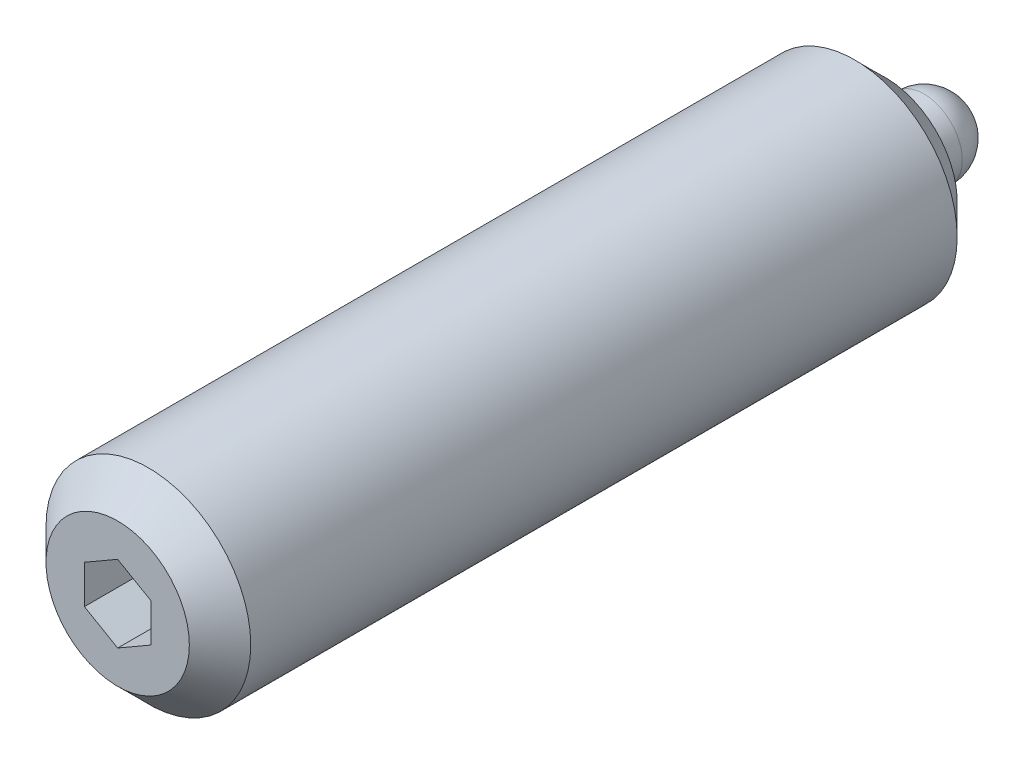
ISO-10303-21;
HEADER;
FILE_DESCRIPTION(('STEP AP214'),'2;1');
FILE_NAME('part.step','',(''),(''),'','','');
FILE_SCHEMA(('AUTOMOTIVE_DESIGN { 1 0 10303 214 1 1 1 1 }'));
ENDSEC;
DATA;
#1=APPLICATION_CONTEXT('core data for automotive mechanical design processes');
#2=APPLICATION_PROTOCOL_DEFINITION('international standard','automotive_design',2000,#1);
#3=PRODUCT_CONTEXT('',#1,'mechanical');
#4=PRODUCT('Part','Part','',(#3));
#5=PRODUCT_RELATED_PRODUCT_CATEGORY('part','',(#4));
#6=PRODUCT_DEFINITION_FORMATION('','',#4);
#7=PRODUCT_DEFINITION_CONTEXT('part definition',#1,'design');
#8=PRODUCT_DEFINITION('design','',#6,#7);
#9=PRODUCT_DEFINITION_SHAPE('','',#8);
#10=(LENGTH_UNIT() NAMED_UNIT(*) SI_UNIT(.MILLI.,.METRE.));
#11=(NAMED_UNIT(*) PLANE_ANGLE_UNIT() SI_UNIT($,.RADIAN.));
#12=(NAMED_UNIT(*) SI_UNIT($,.STERADIAN.) SOLID_ANGLE_UNIT());
#13=UNCERTAINTY_MEASURE_WITH_UNIT(LENGTH_MEASURE(1.E-05),#10,'distance_accuracy_value','');
#14=(GEOMETRIC_REPRESENTATION_CONTEXT(3) GLOBAL_UNCERTAINTY_ASSIGNED_CONTEXT((#13)) GLOBAL_UNIT_ASSIGNED_CONTEXT((#10,
#11,#12)) REPRESENTATION_CONTEXT('',''));
#15=CARTESIAN_POINT('',(0.,0.,0.));
#16=DIRECTION('',(0.,0.,1.));
#17=DIRECTION('',(1.,0.,0.));
#18=AXIS2_PLACEMENT_3D('',#15,#16,#17);
#19=CARTESIAN_POINT('',(0.,2.,16.5));
#20=DIRECTION('',(0.,0.,1.));
#21=DIRECTION('',(1.,0.,0.));
#22=AXIS2_PLACEMENT_3D('',#19,#20,#21);
#23=PLANE('',#22);
#24=CARTESIAN_POINT('',(0.,0.,16.5));
#25=DIRECTION('',(0.,0.,1.));
#26=DIRECTION('',(1.,0.,0.));
#27=AXIS2_PLACEMENT_3D('',#24,#25,#26);
#28=CIRCLE('',#27,1.4);
#29=CARTESIAN_POINT('',(1.4,0.,16.5));
#30=VERTEX_POINT('',#29);
#31=EDGE_CURVE('E9',#30,#30,#28,.T.);
#32=ORIENTED_EDGE('',*,*,#31,.T.);
#33=EDGE_LOOP('',(#32));
#34=FACE_BOUND('',#33,.T.);
#35=DIRECTION('',(0.866025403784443,-0.499999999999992,0.));
#36=VECTOR('',#35,1.);
#37=CARTESIAN_POINT('',(-0.65,-0.375277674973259,16.5));
#38=LINE('',#37,#36);
#39=CARTESIAN_POINT('',(-0.65,-0.375277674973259,16.5));
#40=VERTEX_POINT('',#39);
#41=CARTESIAN_POINT('',(0.,-0.750555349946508,16.5));
#42=VERTEX_POINT('',#41);
#43=EDGE_CURVE('E84',#40,#42,#38,.T.);
#44=ORIENTED_EDGE('',*,*,#43,.F.);
#45=DIRECTION('',(0.,1.,0.));
#46=VECTOR('',#45,1.);
#47=CARTESIAN_POINT('',(-0.65,-0.375277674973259,16.5));
#48=LINE('',#47,#46);
#49=CARTESIAN_POINT('',(-0.65,0.375277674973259,16.5));
#50=VERTEX_POINT('',#49);
#51=EDGE_CURVE('E29',#40,#50,#48,.T.);
#52=ORIENTED_EDGE('',*,*,#51,.T.);
#53=DIRECTION('',(0.866025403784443,0.499999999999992,0.));
#54=VECTOR('',#53,1.);
#55=CARTESIAN_POINT('',(-0.65,0.375277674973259,16.5));
#56=LINE('',#55,#54);
#57=CARTESIAN_POINT('',(0.,0.750555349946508,16.5));
#58=VERTEX_POINT('',#57);
#59=EDGE_CURVE('E74',#50,#58,#56,.T.);
#60=ORIENTED_EDGE('',*,*,#59,.T.);
#61=DIRECTION('',(-0.866025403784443,0.499999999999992,0.));
#62=VECTOR('',#61,1.);
#63=CARTESIAN_POINT('',(0.65,0.375277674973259,16.5));
#64=LINE('',#63,#62);
#65=CARTESIAN_POINT('',(0.65,0.375277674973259,16.5));
#66=VERTEX_POINT('',#65);
#67=EDGE_CURVE('E79',#66,#58,#64,.T.);
#68=ORIENTED_EDGE('',*,*,#67,.F.);
#69=DIRECTION('',(0.,1.,0.));
#70=VECTOR('',#69,1.);
#71=CARTESIAN_POINT('',(0.65,-0.375277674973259,16.5));
#72=LINE('',#71,#70);
#73=CARTESIAN_POINT('',(0.65,-0.375277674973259,16.5));
#74=VERTEX_POINT('',#73);
#75=EDGE_CURVE('E88',#74,#66,#72,.T.);
#76=ORIENTED_EDGE('',*,*,#75,.F.);
#77=DIRECTION('',(-0.866025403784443,-0.499999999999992,0.));
#78=VECTOR('',#77,1.);
#79=CARTESIAN_POINT('',(0.65,-0.375277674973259,16.5));
#80=LINE('',#79,#78);
#81=EDGE_CURVE('E91',#74,#42,#80,.T.);
#82=ORIENTED_EDGE('',*,*,#81,.T.);
#83=EDGE_LOOP('',(#44,#52,#60,#68,#76,#82));
#84=FACE_BOUND('',#83,.T.);
#85=ADVANCED_FACE('F14',(#34,#84),#23,.T.);
#86=CARTESIAN_POINT('',(0.,0.,0.75));
#87=DIRECTION('',(-1.,0.,0.));
#88=DIRECTION('',(0.,0.,1.));
#89=AXIS2_PLACEMENT_3D('',#86,#87,#88);
#90=SPHERICAL_SURFACE('',#89,0.75);
#91=CARTESIAN_POINT('',(0.,0.,0.75));
#92=DIRECTION('',(0.,0.,-1.));
#93=DIRECTION('',(-1.,0.,0.));
#94=AXIS2_PLACEMENT_3D('',#91,#92,#93);
#95=SPHERICAL_SURFACE('',#94,0.75);
#96=CARTESIAN_POINT('',(0.,0.,0.75));
#97=DIRECTION('',(0.,0.,-1.));
#98=DIRECTION('',(-1.,0.,0.));
#99=AXIS2_PLACEMENT_3D('',#96,#97,#98);
#100=CIRCLE('',#99,0.75);
#101=CARTESIAN_POINT('',(-0.75,0.,0.75));
#102=VERTEX_POINT('',#101);
#103=EDGE_CURVE('E70',#102,#102,#100,.T.);
#104=ORIENTED_EDGE('',*,*,#103,.T.);
#105=EDGE_LOOP('',(#104));
#106=FACE_BOUND('',#105,.T.);
#107=ADVANCED_FACE('F152',(#106),#95,.T.);
#108=CARTESIAN_POINT('',(0.,0.,-3.5));
#109=DIRECTION('',(0.,0.,-1.));
#110=DIRECTION('',(-1.,0.,0.));
#111=AXIS2_PLACEMENT_3D('',#108,#109,#110);
#112=CYLINDRICAL_SURFACE('',#111,2.);
#113=CARTESIAN_POINT('',(0.,0.,2.1));
#114=DIRECTION('',(0.,0.,-1.));
#115=DIRECTION('',(-1.,0.,0.));
#116=AXIS2_PLACEMENT_3D('',#113,#114,#115);
#117=CIRCLE('',#116,2.);
#118=CARTESIAN_POINT('',(-2.,0.,2.1));
#119=VERTEX_POINT('',#118);
#120=EDGE_CURVE('E22',#119,#119,#117,.F.);
#121=ORIENTED_EDGE('',*,*,#120,.T.);
#122=EDGE_LOOP('',(#121));
#123=FACE_BOUND('',#122,.T.);
#124=CARTESIAN_POINT('',(0.,0.,15.9));
#125=DIRECTION('',(0.,0.,1.));
#126=DIRECTION('',(1.,0.,0.));
#127=AXIS2_PLACEMENT_3D('',#124,#125,#126);
#128=CIRCLE('',#127,2.);
#129=CARTESIAN_POINT('',(2.,0.,15.9));
#130=VERTEX_POINT('',#129);
#131=EDGE_CURVE('E125',#130,#130,#128,.F.);
#132=ORIENTED_EDGE('',*,*,#131,.T.);
#133=EDGE_LOOP('',(#132));
#134=FACE_BOUND('',#133,.T.);
#135=ADVANCED_FACE('F130',(#123,#134),#112,.T.);
#136=CARTESIAN_POINT('',(0.,0.75,1.5));
#137=DIRECTION('',(0.,0.,-1.));
#138=DIRECTION('',(-1.,0.,0.));
#139=AXIS2_PLACEMENT_3D('',#136,#137,#138);
#140=PLANE('',#139);
#141=CARTESIAN_POINT('',(0.,0.,1.5));
#142=DIRECTION('',(0.,0.,-1.));
#143=DIRECTION('',(-1.,0.,0.));
#144=AXIS2_PLACEMENT_3D('',#141,#142,#143);
#145=CIRCLE('',#144,1.4);
#146=CARTESIAN_POINT('',(-1.4,0.,1.5));
#147=VERTEX_POINT('',#146);
#148=EDGE_CURVE('E122',#147,#147,#145,.T.);
#149=ORIENTED_EDGE('',*,*,#148,.T.);
#150=EDGE_LOOP('',(#149));
#151=FACE_BOUND('',#150,.T.);
#152=CARTESIAN_POINT('',(0.,0.,1.5));
#153=DIRECTION('',(0.,0.,-1.));
#154=DIRECTION('',(-1.,0.,0.));
#155=AXIS2_PLACEMENT_3D('',#152,#153,#154);
#156=CIRCLE('',#155,0.75);
#157=CARTESIAN_POINT('',(-0.75,0.,1.5));
#158=VERTEX_POINT('',#157);
#159=EDGE_CURVE('E119',#158,#158,#156,.T.);
#160=ORIENTED_EDGE('',*,*,#159,.F.);
#161=EDGE_LOOP('',(#160));
#162=FACE_BOUND('',#161,.T.);
#163=ADVANCED_FACE('F140',(#151,#162),#140,.T.);
#164=CARTESIAN_POINT('',(0.,0.,-3.5));
#165=DIRECTION('',(0.,0.,-1.));
#166=DIRECTION('',(-1.,0.,0.));
#167=AXIS2_PLACEMENT_3D('',#164,#165,#166);
#168=CYLINDRICAL_SURFACE('',#167,0.75);
#169=ORIENTED_EDGE('',*,*,#159,.T.);
#170=EDGE_LOOP('',(#169));
#171=FACE_BOUND('',#170,.T.);
#172=ORIENTED_EDGE('',*,*,#103,.F.);
#173=EDGE_LOOP('',(#172));
#174=FACE_BOUND('',#173,.T.);
#175=ADVANCED_FACE('F143',(#171,#174),#168,.T.);
#176=CARTESIAN_POINT('',(-0.65,-0.375277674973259,14.5));
#177=DIRECTION('',(1.,0.,0.));
#178=DIRECTION('',(0.,0.,-1.));
#179=AXIS2_PLACEMENT_3D('',#176,#177,#178);
#180=PLANE('',#179);
#181=DIRECTION('',(0.,0.,1.));
#182=VECTOR('',#181,1.);
#183=CARTESIAN_POINT('',(-0.65,0.375277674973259,14.5));
#184=LINE('',#183,#182);
#185=CARTESIAN_POINT('',(-0.65,0.375277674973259,14.5));
#186=VERTEX_POINT('',#185);
#187=EDGE_CURVE('E63',#186,#50,#184,.T.);
#188=ORIENTED_EDGE('',*,*,#187,.T.);
#189=ORIENTED_EDGE('',*,*,#51,.F.);
#190=DIRECTION('',(0.,0.,1.));
#191=VECTOR('',#190,1.);
#192=CARTESIAN_POINT('',(-0.65,-0.375277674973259,14.5));
#193=LINE('',#192,#191);
#194=CARTESIAN_POINT('',(-0.65,-0.375277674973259,14.5));
#195=VERTEX_POINT('',#194);
#196=EDGE_CURVE('E33',#195,#40,#193,.T.);
#197=ORIENTED_EDGE('',*,*,#196,.F.);
#198=DIRECTION('',(0.,1.,0.));
#199=VECTOR('',#198,1.);
#200=CARTESIAN_POINT('',(-0.65,-0.375277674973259,14.5));
#201=LINE('',#200,#199);
#202=EDGE_CURVE('E66',#195,#186,#201,.T.);
#203=ORIENTED_EDGE('',*,*,#202,.T.);
#204=EDGE_LOOP('',(#188,#189,#197,#203));
#205=FACE_BOUND('',#204,.T.);
#206=ADVANCED_FACE('F65',(#205),#180,.T.);
#207=CARTESIAN_POINT('',(-0.65,0.375277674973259,14.5));
#208=DIRECTION('',(0.499999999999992,-0.866025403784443,0.));
#209=DIRECTION('',(0.866025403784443,0.499999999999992,0.));
#210=AXIS2_PLACEMENT_3D('',#207,#208,#209);
#211=PLANE('',#210);
#212=DIRECTION('',(0.,0.,1.));
#213=VECTOR('',#212,1.);
#214=CARTESIAN_POINT('',(0.,0.750555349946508,14.5));
#215=LINE('',#214,#213);
#216=CARTESIAN_POINT('',(0.,0.750555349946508,14.5));
#217=VERTEX_POINT('',#216);
#218=EDGE_CURVE('E71',#217,#58,#215,.T.);
#219=ORIENTED_EDGE('',*,*,#218,.T.);
#220=ORIENTED_EDGE('',*,*,#59,.F.);
#221=ORIENTED_EDGE('',*,*,#187,.F.);
#222=DIRECTION('',(0.866025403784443,0.499999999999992,0.));
#223=VECTOR('',#222,1.);
#224=CARTESIAN_POINT('',(-0.65,0.375277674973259,14.5));
#225=LINE('',#224,#223);
#226=EDGE_CURVE('E95',#186,#217,#225,.T.);
#227=ORIENTED_EDGE('',*,*,#226,.T.);
#228=EDGE_LOOP('',(#219,#220,#221,#227));
#229=FACE_BOUND('',#228,.T.);
#230=ADVANCED_FACE('F75',(#229),#211,.T.);
#231=CARTESIAN_POINT('',(0.65,0.375277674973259,14.5));
#232=DIRECTION('',(0.499999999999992,0.866025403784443,0.));
#233=DIRECTION('',(-0.866025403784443,0.499999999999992,0.));
#234=AXIS2_PLACEMENT_3D('',#231,#232,#233);
#235=PLANE('',#234);
#236=DIRECTION('',(0.,0.,1.));
#237=VECTOR('',#236,1.);
#238=CARTESIAN_POINT('',(0.65,0.375277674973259,14.5));
#239=LINE('',#238,#237);
#240=CARTESIAN_POINT('',(0.65,0.375277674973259,14.5));
#241=VERTEX_POINT('',#240);
#242=EDGE_CURVE('E114',#241,#66,#239,.T.);
#243=ORIENTED_EDGE('',*,*,#242,.T.);
#244=ORIENTED_EDGE('',*,*,#67,.T.);
#245=ORIENTED_EDGE('',*,*,#218,.F.);
#246=DIRECTION('',(-0.866025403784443,0.499999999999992,0.));
#247=VECTOR('',#246,1.);
#248=CARTESIAN_POINT('',(0.65,0.375277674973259,14.5));
#249=LINE('',#248,#247);
#250=EDGE_CURVE('E97',#241,#217,#249,.T.);
#251=ORIENTED_EDGE('',*,*,#250,.F.);
#252=EDGE_LOOP('',(#243,#244,#245,#251));
#253=FACE_BOUND('',#252,.T.);
#254=ADVANCED_FACE('F167',(#253),#235,.F.);
#255=CARTESIAN_POINT('',(0.65,-0.375277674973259,14.5));
#256=DIRECTION('',(1.,0.,0.));
#257=DIRECTION('',(0.,0.,-1.));
#258=AXIS2_PLACEMENT_3D('',#255,#256,#257);
#259=PLANE('',#258);
#260=DIRECTION('',(0.,0.,1.));
#261=VECTOR('',#260,1.);
#262=CARTESIAN_POINT('',(0.65,-0.375277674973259,14.5));
#263=LINE('',#262,#261);
#264=CARTESIAN_POINT('',(0.65,-0.375277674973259,14.5));
#265=VERTEX_POINT('',#264);
#266=EDGE_CURVE('E112',#265,#74,#263,.T.);
#267=ORIENTED_EDGE('',*,*,#266,.T.);
#268=ORIENTED_EDGE('',*,*,#75,.T.);
#269=ORIENTED_EDGE('',*,*,#242,.F.);
#270=DIRECTION('',(0.,1.,0.));
#271=VECTOR('',#270,1.);
#272=CARTESIAN_POINT('',(0.65,-0.375277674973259,14.5));
#273=LINE('',#272,#271);
#274=EDGE_CURVE('E100',#265,#241,#273,.T.);
#275=ORIENTED_EDGE('',*,*,#274,.F.);
#276=EDGE_LOOP('',(#267,#268,#269,#275));
#277=FACE_BOUND('',#276,.T.);
#278=ADVANCED_FACE('F170',(#277),#259,.F.);
#279=CARTESIAN_POINT('',(0.65,-0.375277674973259,14.5));
#280=DIRECTION('',(-0.499999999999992,0.866025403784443,0.));
#281=DIRECTION('',(-0.866025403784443,-0.499999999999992,0.));
#282=AXIS2_PLACEMENT_3D('',#279,#280,#281);
#283=PLANE('',#282);
#284=DIRECTION('',(0.,0.,1.));
#285=VECTOR('',#284,1.);
#286=CARTESIAN_POINT('',(0.,-0.750555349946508,14.5));
#287=LINE('',#286,#285);
#288=CARTESIAN_POINT('',(0.,-0.750555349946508,14.5));
#289=VERTEX_POINT('',#288);
#290=EDGE_CURVE('E110',#289,#42,#287,.T.);
#291=ORIENTED_EDGE('',*,*,#290,.T.);
#292=ORIENTED_EDGE('',*,*,#81,.F.);
#293=ORIENTED_EDGE('',*,*,#266,.F.);
#294=DIRECTION('',(-0.866025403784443,-0.499999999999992,0.));
#295=VECTOR('',#294,1.);
#296=CARTESIAN_POINT('',(0.65,-0.375277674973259,14.5));
#297=LINE('',#296,#295);
#298=EDGE_CURVE('E103',#265,#289,#297,.T.);
#299=ORIENTED_EDGE('',*,*,#298,.T.);
#300=EDGE_LOOP('',(#291,#292,#293,#299));
#301=FACE_BOUND('',#300,.T.);
#302=ADVANCED_FACE('F174',(#301),#283,.T.);
#303=CARTESIAN_POINT('',(-0.65,-0.375277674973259,14.5));
#304=DIRECTION('',(-0.499999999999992,-0.866025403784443,0.));
#305=DIRECTION('',(0.866025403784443,-0.499999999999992,0.));
#306=AXIS2_PLACEMENT_3D('',#303,#304,#305);
#307=PLANE('',#306);
#308=DIRECTION('',(0.866025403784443,-0.499999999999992,0.));
#309=VECTOR('',#308,1.);
#310=CARTESIAN_POINT('',(-0.65,-0.375277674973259,14.5));
#311=LINE('',#310,#309);
#312=EDGE_CURVE('E106',#195,#289,#311,.T.);
#313=ORIENTED_EDGE('',*,*,#312,.F.);
#314=ORIENTED_EDGE('',*,*,#196,.T.);
#315=ORIENTED_EDGE('',*,*,#43,.T.);
#316=ORIENTED_EDGE('',*,*,#290,.F.);
#317=EDGE_LOOP('',(#313,#314,#315,#316));
#318=FACE_BOUND('',#317,.T.);
#319=ADVANCED_FACE('F137',(#318),#307,.F.);
#320=CARTESIAN_POINT('',(-0.65,0.375277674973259,14.5));
#321=DIRECTION('',(0.,0.,-1.));
#322=DIRECTION('',(-1.,0.,0.));
#323=AXIS2_PLACEMENT_3D('',#320,#321,#322);
#324=PLANE('',#323);
#325=ORIENTED_EDGE('',*,*,#202,.F.);
#326=ORIENTED_EDGE('',*,*,#312,.T.);
#327=ORIENTED_EDGE('',*,*,#298,.F.);
#328=ORIENTED_EDGE('',*,*,#274,.T.);
#329=ORIENTED_EDGE('',*,*,#250,.T.);
#330=ORIENTED_EDGE('',*,*,#226,.F.);
#331=EDGE_LOOP('',(#325,#326,#327,#328,#329,#330));
#332=FACE_BOUND('',#331,.T.);
#333=ADVANCED_FACE('F136',(#332),#324,.F.);
#334=CARTESIAN_POINT('',(0.,0.,1.5));
#335=DIRECTION('',(0.,0.,1.));
#336=DIRECTION('',(1.,0.,0.));
#337=AXIS2_PLACEMENT_3D('',#334,#335,#336);
#338=CONICAL_SURFACE('',#337,1.4,0.785398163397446);
#339=ORIENTED_EDGE('',*,*,#120,.F.);
#340=EDGE_LOOP('',(#339));
#341=FACE_BOUND('',#340,.T.);
#342=ORIENTED_EDGE('',*,*,#148,.F.);
#343=EDGE_LOOP('',(#342));
#344=FACE_BOUND('',#343,.T.);
#345=ADVANCED_FACE('F133',(#341,#344),#338,.T.);
#346=CARTESIAN_POINT('',(0.,0.,15.9));
#347=DIRECTION('',(0.,0.,-1.));
#348=DIRECTION('',(-1.,0.,0.));
#349=AXIS2_PLACEMENT_3D('',#346,#347,#348);
#350=CONICAL_SURFACE('',#349,2.,0.785398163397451);
#351=ORIENTED_EDGE('',*,*,#31,.F.);
#352=EDGE_LOOP('',(#351));
#353=FACE_BOUND('',#352,.T.);
#354=ORIENTED_EDGE('',*,*,#131,.F.);
#355=EDGE_LOOP('',(#354));
#356=FACE_BOUND('',#355,.T.);
#357=ADVANCED_FACE('F16',(#353,#356),#350,.T.);
#358=CLOSED_SHELL('',(#85,#107,#135,#163,#175,#206,#230,#254,#278,#302,#319,#333,#345,#357));
#359=MANIFOLD_SOLID_BREP('B1',#358);
#360=ADVANCED_BREP_SHAPE_REPRESENTATION('',(#18,#359),#14);
#361=SHAPE_DEFINITION_REPRESENTATION(#9,#360);
ENDSEC;
END-ISO-10303-21;
